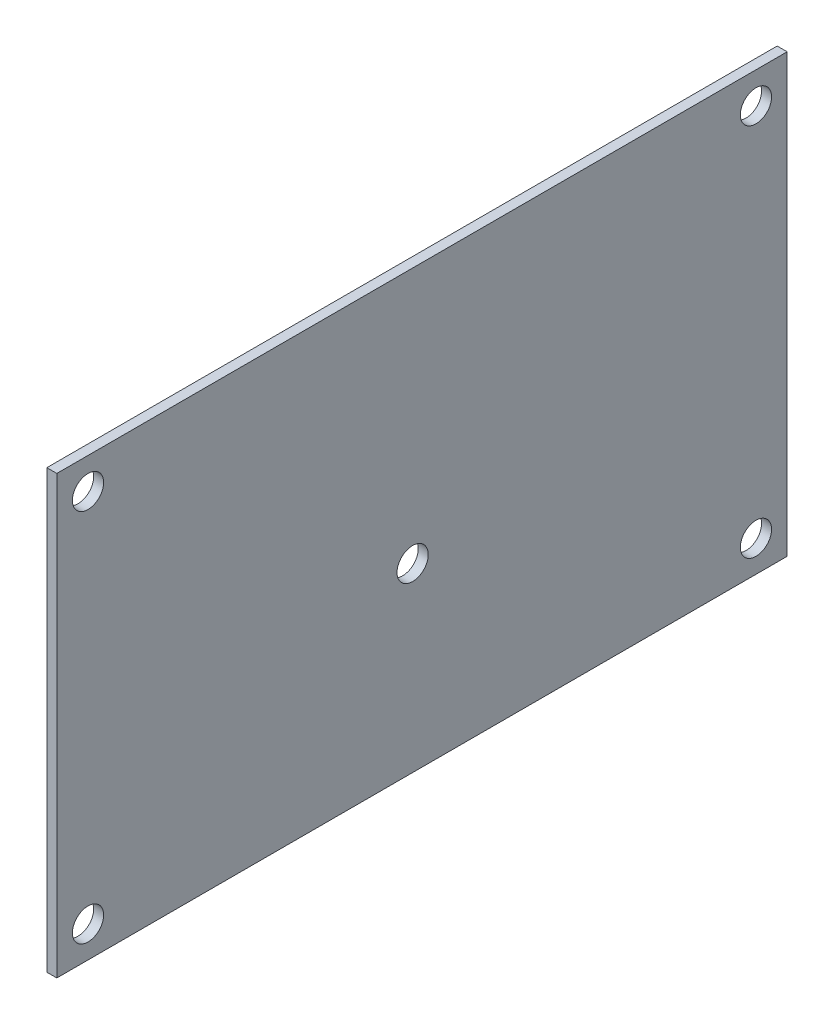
from build123d import *

# Parameters (mm, degrees)
SKETCH1_W           = 117
SKETCH1_H           = 70
BOSS_EXTRUDE1_DEPTH = 1.6
SKETCH2_R           = 2.5
CUT_EXTRUDE1_DEPTH  = 137.350870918


with BuildPart() as part:
    # Sketch1 → Boss-Extrude1 (new body)
    with BuildSketch(Plane(origin=(0, 0, 0), x_dir=(0, 0, -1), z_dir=(1, 0, 0))):
        with Locations((58.5, 35)):
            Rectangle(SKETCH1_W, SKETCH1_H)
    extrude(amount=BOSS_EXTRUDE1_DEPTH)

    # Sketch2 → Cut-Extrude1 (cut, through all)
    with BuildSketch(Plane(origin=(1.6, 0, 0), x_dir=(0, 0, -1), z_dir=(1, 0, 0))):
        with Locations((5, 65)):
            Circle(SKETCH2_R)
        with Locations((5, 5)):
            Circle(SKETCH2_R)
        with Locations((112, 5)):
            Circle(SKETCH2_R)
        with Locations((112, 65)):
            Circle(SKETCH2_R)
        with Locations((57, 29)):
            Circle(SKETCH2_R)
    extrude(amount=-CUT_EXTRUDE1_DEPTH, mode=Mode.SUBTRACT)


solid = part.part
